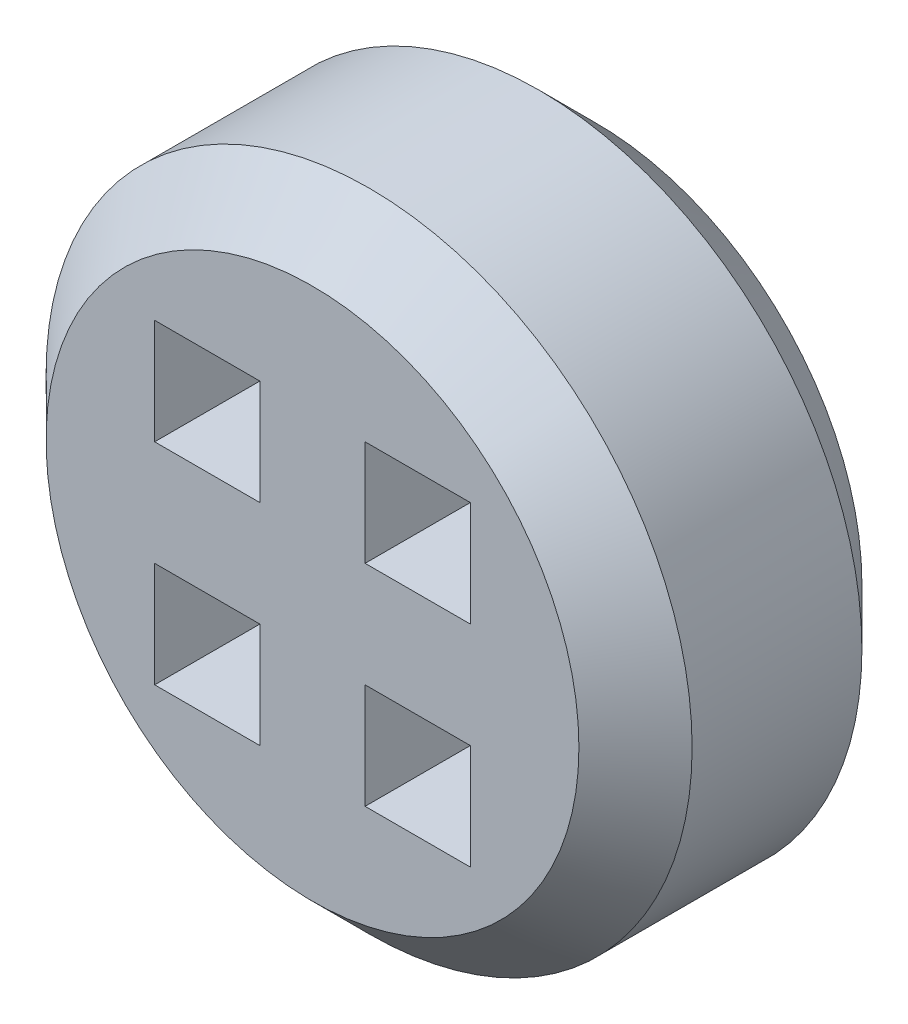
ISO-10303-21;
HEADER;
FILE_DESCRIPTION(('STEP AP214'),'2;1');
FILE_NAME('part.step','',(''),(''),'','','');
FILE_SCHEMA(('AUTOMOTIVE_DESIGN { 1 0 10303 214 1 1 1 1 }'));
ENDSEC;
DATA;
#1=APPLICATION_CONTEXT('core data for automotive mechanical design processes');
#2=APPLICATION_PROTOCOL_DEFINITION('international standard','automotive_design',2000,#1);
#3=PRODUCT_CONTEXT('',#1,'mechanical');
#4=PRODUCT('Part','Part','',(#3));
#5=PRODUCT_RELATED_PRODUCT_CATEGORY('part','',(#4));
#6=PRODUCT_DEFINITION_FORMATION('','',#4);
#7=PRODUCT_DEFINITION_CONTEXT('part definition',#1,'design');
#8=PRODUCT_DEFINITION('design','',#6,#7);
#9=PRODUCT_DEFINITION_SHAPE('','',#8);
#10=(LENGTH_UNIT() NAMED_UNIT(*) SI_UNIT(.MILLI.,.METRE.));
#11=(NAMED_UNIT(*) PLANE_ANGLE_UNIT() SI_UNIT($,.RADIAN.));
#12=(NAMED_UNIT(*) SI_UNIT($,.STERADIAN.) SOLID_ANGLE_UNIT());
#13=UNCERTAINTY_MEASURE_WITH_UNIT(LENGTH_MEASURE(1.E-05),#10,'distance_accuracy_value','');
#14=(GEOMETRIC_REPRESENTATION_CONTEXT(3) GLOBAL_UNCERTAINTY_ASSIGNED_CONTEXT((#13)) GLOBAL_UNIT_ASSIGNED_CONTEXT((#10,
#11,#12)) REPRESENTATION_CONTEXT('',''));
#15=CARTESIAN_POINT('',(0.,0.,0.));
#16=DIRECTION('',(0.,0.,1.));
#17=DIRECTION('',(1.,0.,0.));
#18=AXIS2_PLACEMENT_3D('',#15,#16,#17);
#19=CARTESIAN_POINT('',(0.,0.,50.));
#20=DIRECTION('',(0.,0.,-1.));
#21=DIRECTION('',(-1.,0.,0.));
#22=AXIS2_PLACEMENT_3D('',#19,#20,#21);
#23=CYLINDRICAL_SURFACE('',#22,57.0709565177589);
#24=CARTESIAN_POINT('',(0.,0.,10.));
#25=DIRECTION('',(0.,0.,1.));
#26=DIRECTION('',(1.,0.,0.));
#27=AXIS2_PLACEMENT_3D('',#24,#25,#26);
#28=CIRCLE('',#27,57.0709565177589);
#29=CARTESIAN_POINT('',(57.0709565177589,0.,10.));
#30=VERTEX_POINT('',#29);
#31=EDGE_CURVE('E277',#30,#30,#28,.T.);
#32=ORIENTED_EDGE('',*,*,#31,.T.);
#33=EDGE_LOOP('',(#32));
#34=FACE_BOUND('',#33,.T.);
#35=CARTESIAN_POINT('',(0.,0.,40.));
#36=DIRECTION('',(0.,0.,1.));
#37=DIRECTION('',(1.,0.,0.));
#38=AXIS2_PLACEMENT_3D('',#35,#36,#37);
#39=CIRCLE('',#38,57.0709565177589);
#40=CARTESIAN_POINT('',(57.0709565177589,0.,40.));
#41=VERTEX_POINT('',#40);
#42=EDGE_CURVE('E274',#41,#41,#39,.F.);
#43=ORIENTED_EDGE('',*,*,#42,.T.);
#44=EDGE_LOOP('',(#43));
#45=FACE_BOUND('',#44,.T.);
#46=ADVANCED_FACE('F32',(#34,#45),#23,.T.);
#47=CARTESIAN_POINT('',(0.,0.,50.));
#48=DIRECTION('',(0.,0.,1.));
#49=DIRECTION('',(1.,0.,0.));
#50=AXIS2_PLACEMENT_3D('',#47,#48,#49);
#51=PLANE('',#50);
#52=CARTESIAN_POINT('',(0.,0.,50.));
#53=DIRECTION('',(0.,0.,1.));
#54=DIRECTION('',(1.,0.,0.));
#55=AXIS2_PLACEMENT_3D('',#52,#53,#54);
#56=CIRCLE('',#55,47.070956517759);
#57=CARTESIAN_POINT('',(47.070956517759,0.,50.));
#58=VERTEX_POINT('',#57);
#59=EDGE_CURVE('E11',#58,#58,#56,.T.);
#60=ORIENTED_EDGE('',*,*,#59,.T.);
#61=EDGE_LOOP('',(#60));
#62=FACE_BOUND('',#61,.T.);
#63=DIRECTION('',(0.,1.,0.));
#64=VECTOR('',#63,1.);
#65=CARTESIAN_POINT('',(-9.29559077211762,-9.29559077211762,50.));
#66=LINE('',#65,#64);
#67=CARTESIAN_POINT('',(-9.29559077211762,-27.8867723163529,50.));
#68=VERTEX_POINT('',#67);
#69=CARTESIAN_POINT('',(-9.29559077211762,-9.29559077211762,50.));
#70=VERTEX_POINT('',#69);
#71=EDGE_CURVE('E47',#68,#70,#66,.T.);
#72=ORIENTED_EDGE('',*,*,#71,.F.);
#73=DIRECTION('',(1.,0.,0.));
#74=VECTOR('',#73,1.);
#75=CARTESIAN_POINT('',(-27.8867723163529,-27.8867723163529,50.));
#76=LINE('',#75,#74);
#77=CARTESIAN_POINT('',(-27.8867723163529,-27.8867723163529,50.));
#78=VERTEX_POINT('',#77);
#79=EDGE_CURVE('E153',#78,#68,#76,.T.);
#80=ORIENTED_EDGE('',*,*,#79,.F.);
#81=DIRECTION('',(0.,-1.,0.));
#82=VECTOR('',#81,1.);
#83=CARTESIAN_POINT('',(-27.8867723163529,-9.29559077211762,50.));
#84=LINE('',#83,#82);
#85=CARTESIAN_POINT('',(-27.8867723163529,-9.29559077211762,50.));
#86=VERTEX_POINT('',#85);
#87=EDGE_CURVE('E173',#86,#78,#84,.T.);
#88=ORIENTED_EDGE('',*,*,#87,.F.);
#89=DIRECTION('',(-1.,0.,0.));
#90=VECTOR('',#89,1.);
#91=CARTESIAN_POINT('',(-27.8867723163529,-9.29559077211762,50.));
#92=LINE('',#91,#90);
#93=EDGE_CURVE('E167',#70,#86,#92,.T.);
#94=ORIENTED_EDGE('',*,*,#93,.F.);
#95=EDGE_LOOP('',(#72,#80,#88,#94));
#96=FACE_BOUND('',#95,.T.);
#97=DIRECTION('',(0.,-1.,0.));
#98=VECTOR('',#97,1.);
#99=CARTESIAN_POINT('',(9.29559077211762,-9.29559077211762,50.));
#100=LINE('',#99,#98);
#101=CARTESIAN_POINT('',(9.29559077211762,-9.29559077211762,50.));
#102=VERTEX_POINT('',#101);
#103=CARTESIAN_POINT('',(9.29559077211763,-27.8867723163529,50.));
#104=VERTEX_POINT('',#103);
#105=EDGE_CURVE('E189',#102,#104,#100,.T.);
#106=ORIENTED_EDGE('',*,*,#105,.F.);
#107=DIRECTION('',(-1.,0.,0.));
#108=VECTOR('',#107,1.);
#109=CARTESIAN_POINT('',(9.29559077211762,-9.29559077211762,50.));
#110=LINE('',#109,#108);
#111=CARTESIAN_POINT('',(27.8867723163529,-9.29559077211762,50.));
#112=VERTEX_POINT('',#111);
#113=EDGE_CURVE('E197',#112,#102,#110,.T.);
#114=ORIENTED_EDGE('',*,*,#113,.F.);
#115=DIRECTION('',(0.,1.,0.));
#116=VECTOR('',#115,1.);
#117=CARTESIAN_POINT('',(27.8867723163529,-9.29559077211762,50.));
#118=LINE('',#117,#116);
#119=CARTESIAN_POINT('',(27.8867723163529,-27.8867723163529,50.));
#120=VERTEX_POINT('',#119);
#121=EDGE_CURVE('E194',#120,#112,#118,.T.);
#122=ORIENTED_EDGE('',*,*,#121,.F.);
#123=DIRECTION('',(1.,0.,0.));
#124=VECTOR('',#123,1.);
#125=CARTESIAN_POINT('',(9.29559077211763,-27.8867723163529,50.));
#126=LINE('',#125,#124);
#127=EDGE_CURVE('E191',#104,#120,#126,.T.);
#128=ORIENTED_EDGE('',*,*,#127,.F.);
#129=EDGE_LOOP('',(#106,#114,#122,#128));
#130=FACE_BOUND('',#129,.T.);
#131=DIRECTION('',(0.,1.,0.));
#132=VECTOR('',#131,1.);
#133=CARTESIAN_POINT('',(-9.29559077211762,27.8867723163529,50.));
#134=LINE('',#133,#132);
#135=CARTESIAN_POINT('',(-9.29559077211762,9.29559077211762,50.));
#136=VERTEX_POINT('',#135);
#137=CARTESIAN_POINT('',(-9.29559077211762,27.8867723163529,50.));
#138=VERTEX_POINT('',#137);
#139=EDGE_CURVE('E220',#136,#138,#134,.T.);
#140=ORIENTED_EDGE('',*,*,#139,.F.);
#141=DIRECTION('',(1.,0.,0.));
#142=VECTOR('',#141,1.);
#143=CARTESIAN_POINT('',(-27.8867723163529,9.29559077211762,50.));
#144=LINE('',#143,#142);
#145=CARTESIAN_POINT('',(-27.8867723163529,9.29559077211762,50.));
#146=VERTEX_POINT('',#145);
#147=EDGE_CURVE('E228',#146,#136,#144,.T.);
#148=ORIENTED_EDGE('',*,*,#147,.F.);
#149=DIRECTION('',(0.,-1.,0.));
#150=VECTOR('',#149,1.);
#151=CARTESIAN_POINT('',(-27.8867723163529,27.8867723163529,50.));
#152=LINE('',#151,#150);
#153=CARTESIAN_POINT('',(-27.8867723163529,27.8867723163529,50.));
#154=VERTEX_POINT('',#153);
#155=EDGE_CURVE('E225',#154,#146,#152,.T.);
#156=ORIENTED_EDGE('',*,*,#155,.F.);
#157=DIRECTION('',(-1.,0.,0.));
#158=VECTOR('',#157,1.);
#159=CARTESIAN_POINT('',(-27.8867723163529,27.8867723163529,50.));
#160=LINE('',#159,#158);
#161=EDGE_CURVE('E222',#138,#154,#160,.T.);
#162=ORIENTED_EDGE('',*,*,#161,.F.);
#163=EDGE_LOOP('',(#140,#148,#156,#162));
#164=FACE_BOUND('',#163,.T.);
#165=DIRECTION('',(0.,-1.,0.));
#166=VECTOR('',#165,1.);
#167=CARTESIAN_POINT('',(9.29559077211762,27.8867723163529,50.));
#168=LINE('',#167,#166);
#169=CARTESIAN_POINT('',(9.29559077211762,27.8867723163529,50.));
#170=VERTEX_POINT('',#169);
#171=CARTESIAN_POINT('',(9.29559077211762,9.29559077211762,50.));
#172=VERTEX_POINT('',#171);
#173=EDGE_CURVE('E251',#170,#172,#168,.T.);
#174=ORIENTED_EDGE('',*,*,#173,.F.);
#175=DIRECTION('',(-1.,0.,0.));
#176=VECTOR('',#175,1.);
#177=CARTESIAN_POINT('',(9.29559077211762,27.8867723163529,50.));
#178=LINE('',#177,#176);
#179=CARTESIAN_POINT('',(27.8867723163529,27.8867723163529,50.));
#180=VERTEX_POINT('',#179);
#181=EDGE_CURVE('E259',#180,#170,#178,.T.);
#182=ORIENTED_EDGE('',*,*,#181,.F.);
#183=DIRECTION('',(0.,1.,0.));
#184=VECTOR('',#183,1.);
#185=CARTESIAN_POINT('',(27.8867723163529,27.8867723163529,50.));
#186=LINE('',#185,#184);
#187=CARTESIAN_POINT('',(27.8867723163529,9.29559077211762,50.));
#188=VERTEX_POINT('',#187);
#189=EDGE_CURVE('E256',#188,#180,#186,.T.);
#190=ORIENTED_EDGE('',*,*,#189,.F.);
#191=DIRECTION('',(1.,0.,0.));
#192=VECTOR('',#191,1.);
#193=CARTESIAN_POINT('',(9.29559077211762,9.29559077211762,50.));
#194=LINE('',#193,#192);
#195=EDGE_CURVE('E253',#172,#188,#194,.T.);
#196=ORIENTED_EDGE('',*,*,#195,.F.);
#197=EDGE_LOOP('',(#174,#182,#190,#196));
#198=FACE_BOUND('',#197,.T.);
#199=ADVANCED_FACE('F290',(#62,#96,#130,#164,#198),#51,.T.);
#200=CARTESIAN_POINT('',(0.,0.,0.));
#201=DIRECTION('',(0.,0.,1.));
#202=DIRECTION('',(1.,0.,0.));
#203=AXIS2_PLACEMENT_3D('',#200,#201,#202);
#204=PLANE('',#203);
#205=CARTESIAN_POINT('',(0.,0.,0.));
#206=DIRECTION('',(0.,0.,1.));
#207=DIRECTION('',(1.,0.,0.));
#208=AXIS2_PLACEMENT_3D('',#205,#206,#207);
#209=CIRCLE('',#208,47.0709565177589);
#210=CARTESIAN_POINT('',(47.0709565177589,0.,0.));
#211=VERTEX_POINT('',#210);
#212=EDGE_CURVE('E40',#211,#211,#209,.F.);
#213=ORIENTED_EDGE('',*,*,#212,.T.);
#214=EDGE_LOOP('',(#213));
#215=FACE_BOUND('',#214,.T.);
#216=DIRECTION('',(-1.,0.,0.));
#217=VECTOR('',#216,1.);
#218=CARTESIAN_POINT('',(-27.8867723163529,-27.8867723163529,0.));
#219=LINE('',#218,#217);
#220=CARTESIAN_POINT('',(-9.29559077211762,-27.8867723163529,0.));
#221=VERTEX_POINT('',#220);
#222=CARTESIAN_POINT('',(-27.8867723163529,-27.8867723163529,0.));
#223=VERTEX_POINT('',#222);
#224=EDGE_CURVE('E165',#221,#223,#219,.T.);
#225=ORIENTED_EDGE('',*,*,#224,.F.);
#226=DIRECTION('',(0.,-1.,0.));
#227=VECTOR('',#226,1.);
#228=CARTESIAN_POINT('',(-9.29559077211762,-9.29559077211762,0.));
#229=LINE('',#228,#227);
#230=CARTESIAN_POINT('',(-9.29559077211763,-9.29559077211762,0.));
#231=VERTEX_POINT('',#230);
#232=EDGE_CURVE('E147',#231,#221,#229,.T.);
#233=ORIENTED_EDGE('',*,*,#232,.F.);
#234=DIRECTION('',(1.,0.,0.));
#235=VECTOR('',#234,1.);
#236=CARTESIAN_POINT('',(-27.8867723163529,-9.29559077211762,0.));
#237=LINE('',#236,#235);
#238=CARTESIAN_POINT('',(-27.8867723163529,-9.29559077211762,0.));
#239=VERTEX_POINT('',#238);
#240=EDGE_CURVE('E156',#239,#231,#237,.T.);
#241=ORIENTED_EDGE('',*,*,#240,.F.);
#242=DIRECTION('',(0.,1.,0.));
#243=VECTOR('',#242,1.);
#244=CARTESIAN_POINT('',(-27.8867723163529,-9.29559077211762,0.));
#245=LINE('',#244,#243);
#246=EDGE_CURVE('E55',#223,#239,#245,.T.);
#247=ORIENTED_EDGE('',*,*,#246,.F.);
#248=EDGE_LOOP('',(#225,#233,#241,#247));
#249=FACE_BOUND('',#248,.T.);
#250=DIRECTION('',(1.,0.,0.));
#251=VECTOR('',#250,1.);
#252=CARTESIAN_POINT('',(9.29559077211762,-9.29559077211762,0.));
#253=LINE('',#252,#251);
#254=CARTESIAN_POINT('',(9.29559077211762,-9.29559077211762,0.));
#255=VERTEX_POINT('',#254);
#256=CARTESIAN_POINT('',(27.8867723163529,-9.29559077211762,0.));
#257=VERTEX_POINT('',#256);
#258=EDGE_CURVE('E183',#255,#257,#253,.T.);
#259=ORIENTED_EDGE('',*,*,#258,.F.);
#260=DIRECTION('',(0.,1.,0.));
#261=VECTOR('',#260,1.);
#262=CARTESIAN_POINT('',(9.29559077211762,-9.29559077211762,0.));
#263=LINE('',#262,#261);
#264=CARTESIAN_POINT('',(9.29559077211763,-27.8867723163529,0.));
#265=VERTEX_POINT('',#264);
#266=EDGE_CURVE('E186',#265,#255,#263,.T.);
#267=ORIENTED_EDGE('',*,*,#266,.F.);
#268=DIRECTION('',(-1.,0.,0.));
#269=VECTOR('',#268,1.);
#270=CARTESIAN_POINT('',(9.29559077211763,-27.8867723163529,0.));
#271=LINE('',#270,#269);
#272=CARTESIAN_POINT('',(27.8867723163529,-27.8867723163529,0.));
#273=VERTEX_POINT('',#272);
#274=EDGE_CURVE('E203',#273,#265,#271,.T.);
#275=ORIENTED_EDGE('',*,*,#274,.F.);
#276=DIRECTION('',(0.,-1.,0.));
#277=VECTOR('',#276,1.);
#278=CARTESIAN_POINT('',(27.8867723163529,-9.29559077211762,0.));
#279=LINE('',#278,#277);
#280=EDGE_CURVE('E159',#257,#273,#279,.T.);
#281=ORIENTED_EDGE('',*,*,#280,.F.);
#282=EDGE_LOOP('',(#259,#267,#275,#281));
#283=FACE_BOUND('',#282,.T.);
#284=DIRECTION('',(-1.,0.,0.));
#285=VECTOR('',#284,1.);
#286=CARTESIAN_POINT('',(-27.8867723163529,9.29559077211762,0.));
#287=LINE('',#286,#285);
#288=CARTESIAN_POINT('',(-9.29559077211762,9.29559077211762,0.));
#289=VERTEX_POINT('',#288);
#290=CARTESIAN_POINT('',(-27.8867723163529,9.29559077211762,0.));
#291=VERTEX_POINT('',#290);
#292=EDGE_CURVE('E214',#289,#291,#287,.T.);
#293=ORIENTED_EDGE('',*,*,#292,.F.);
#294=DIRECTION('',(0.,-1.,0.));
#295=VECTOR('',#294,1.);
#296=CARTESIAN_POINT('',(-9.29559077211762,27.8867723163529,0.));
#297=LINE('',#296,#295);
#298=CARTESIAN_POINT('',(-9.29559077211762,27.8867723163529,0.));
#299=VERTEX_POINT('',#298);
#300=EDGE_CURVE('E217',#299,#289,#297,.T.);
#301=ORIENTED_EDGE('',*,*,#300,.F.);
#302=DIRECTION('',(1.,0.,0.));
#303=VECTOR('',#302,1.);
#304=CARTESIAN_POINT('',(-27.8867723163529,27.8867723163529,0.));
#305=LINE('',#304,#303);
#306=CARTESIAN_POINT('',(-27.8867723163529,27.8867723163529,0.));
#307=VERTEX_POINT('',#306);
#308=EDGE_CURVE('E234',#307,#299,#305,.T.);
#309=ORIENTED_EDGE('',*,*,#308,.F.);
#310=DIRECTION('',(0.,1.,0.));
#311=VECTOR('',#310,1.);
#312=CARTESIAN_POINT('',(-27.8867723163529,27.8867723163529,0.));
#313=LINE('',#312,#311);
#314=EDGE_CURVE('E212',#291,#307,#313,.T.);
#315=ORIENTED_EDGE('',*,*,#314,.F.);
#316=EDGE_LOOP('',(#293,#301,#309,#315));
#317=FACE_BOUND('',#316,.T.);
#318=DIRECTION('',(1.,0.,0.));
#319=VECTOR('',#318,1.);
#320=CARTESIAN_POINT('',(9.29559077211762,27.8867723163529,0.));
#321=LINE('',#320,#319);
#322=CARTESIAN_POINT('',(9.29559077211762,27.8867723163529,0.));
#323=VERTEX_POINT('',#322);
#324=CARTESIAN_POINT('',(27.8867723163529,27.8867723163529,0.));
#325=VERTEX_POINT('',#324);
#326=EDGE_CURVE('E245',#323,#325,#321,.T.);
#327=ORIENTED_EDGE('',*,*,#326,.F.);
#328=DIRECTION('',(0.,1.,0.));
#329=VECTOR('',#328,1.);
#330=CARTESIAN_POINT('',(9.29559077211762,27.8867723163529,0.));
#331=LINE('',#330,#329);
#332=CARTESIAN_POINT('',(9.29559077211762,9.29559077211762,0.));
#333=VERTEX_POINT('',#332);
#334=EDGE_CURVE('E248',#333,#323,#331,.T.);
#335=ORIENTED_EDGE('',*,*,#334,.F.);
#336=DIRECTION('',(-1.,0.,0.));
#337=VECTOR('',#336,1.);
#338=CARTESIAN_POINT('',(9.29559077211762,9.29559077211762,0.));
#339=LINE('',#338,#337);
#340=CARTESIAN_POINT('',(27.8867723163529,9.29559077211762,0.));
#341=VERTEX_POINT('',#340);
#342=EDGE_CURVE('E265',#341,#333,#339,.T.);
#343=ORIENTED_EDGE('',*,*,#342,.F.);
#344=DIRECTION('',(0.,-1.,0.));
#345=VECTOR('',#344,1.);
#346=CARTESIAN_POINT('',(27.8867723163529,27.8867723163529,0.));
#347=LINE('',#346,#345);
#348=EDGE_CURVE('E243',#325,#341,#347,.T.);
#349=ORIENTED_EDGE('',*,*,#348,.F.);
#350=EDGE_LOOP('',(#327,#335,#343,#349));
#351=FACE_BOUND('',#350,.T.);
#352=ADVANCED_FACE('F162',(#215,#249,#283,#317,#351),#204,.F.);
#353=CARTESIAN_POINT('',(9.29559077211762,27.8867723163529,-0.001000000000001));
#354=DIRECTION('',(-1.,0.,0.));
#355=DIRECTION('',(0.,0.,1.));
#356=AXIS2_PLACEMENT_3D('',#353,#354,#355);
#357=PLANE('',#356);
#358=ORIENTED_EDGE('',*,*,#334,.T.);
#359=DIRECTION('',(0.,0.,1.));
#360=VECTOR('',#359,1.);
#361=CARTESIAN_POINT('',(9.29559077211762,27.8867723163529,-0.001000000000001));
#362=LINE('',#361,#360);
#363=EDGE_CURVE('E263',#323,#170,#362,.T.);
#364=ORIENTED_EDGE('',*,*,#363,.T.);
#365=ORIENTED_EDGE('',*,*,#173,.T.);
#366=DIRECTION('',(0.,0.,1.));
#367=VECTOR('',#366,1.);
#368=CARTESIAN_POINT('',(9.29559077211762,9.29559077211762,-0.001000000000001));
#369=LINE('',#368,#367);
#370=EDGE_CURVE('E262',#333,#172,#369,.T.);
#371=ORIENTED_EDGE('',*,*,#370,.F.);
#372=EDGE_LOOP('',(#358,#364,#365,#371));
#373=FACE_BOUND('',#372,.T.);
#374=ADVANCED_FACE('F316',(#373),#357,.F.);
#375=CARTESIAN_POINT('',(9.29559077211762,27.8867723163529,-0.001000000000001));
#376=DIRECTION('',(0.,1.,0.));
#377=DIRECTION('',(0.,0.,1.));
#378=AXIS2_PLACEMENT_3D('',#375,#376,#377);
#379=PLANE('',#378);
#380=ORIENTED_EDGE('',*,*,#326,.T.);
#381=DIRECTION('',(0.,0.,1.));
#382=VECTOR('',#381,1.);
#383=CARTESIAN_POINT('',(27.8867723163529,27.8867723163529,-0.001000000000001));
#384=LINE('',#383,#382);
#385=EDGE_CURVE('E266',#325,#180,#384,.T.);
#386=ORIENTED_EDGE('',*,*,#385,.T.);
#387=ORIENTED_EDGE('',*,*,#181,.T.);
#388=ORIENTED_EDGE('',*,*,#363,.F.);
#389=EDGE_LOOP('',(#380,#386,#387,#388));
#390=FACE_BOUND('',#389,.T.);
#391=ADVANCED_FACE('F326',(#390),#379,.F.);
#392=CARTESIAN_POINT('',(27.8867723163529,27.8867723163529,-0.001000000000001));
#393=DIRECTION('',(1.,0.,0.));
#394=DIRECTION('',(0.,0.,-1.));
#395=AXIS2_PLACEMENT_3D('',#392,#393,#394);
#396=PLANE('',#395);
#397=ORIENTED_EDGE('',*,*,#348,.T.);
#398=DIRECTION('',(0.,0.,1.));
#399=VECTOR('',#398,1.);
#400=CARTESIAN_POINT('',(27.8867723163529,9.29559077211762,-0.001000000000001));
#401=LINE('',#400,#399);
#402=EDGE_CURVE('E268',#341,#188,#401,.T.);
#403=ORIENTED_EDGE('',*,*,#402,.T.);
#404=ORIENTED_EDGE('',*,*,#189,.T.);
#405=ORIENTED_EDGE('',*,*,#385,.F.);
#406=EDGE_LOOP('',(#397,#403,#404,#405));
#407=FACE_BOUND('',#406,.T.);
#408=ADVANCED_FACE('F328',(#407),#396,.F.);
#409=CARTESIAN_POINT('',(9.29559077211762,9.29559077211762,-0.001000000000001));
#410=DIRECTION('',(0.,-1.,0.));
#411=DIRECTION('',(0.,0.,-1.));
#412=AXIS2_PLACEMENT_3D('',#409,#410,#411);
#413=PLANE('',#412);
#414=ORIENTED_EDGE('',*,*,#342,.T.);
#415=ORIENTED_EDGE('',*,*,#370,.T.);
#416=ORIENTED_EDGE('',*,*,#195,.T.);
#417=ORIENTED_EDGE('',*,*,#402,.F.);
#418=EDGE_LOOP('',(#414,#415,#416,#417));
#419=FACE_BOUND('',#418,.T.);
#420=ADVANCED_FACE('F318',(#419),#413,.F.);
#421=CARTESIAN_POINT('',(-9.29559077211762,27.8867723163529,-0.001000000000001));
#422=DIRECTION('',(1.,0.,0.));
#423=DIRECTION('',(0.,0.,-1.));
#424=AXIS2_PLACEMENT_3D('',#421,#422,#423);
#425=PLANE('',#424);
#426=ORIENTED_EDGE('',*,*,#300,.T.);
#427=DIRECTION('',(0.,0.,1.));
#428=VECTOR('',#427,1.);
#429=CARTESIAN_POINT('',(-9.29559077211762,9.29559077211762,-0.001000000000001));
#430=LINE('',#429,#428);
#431=EDGE_CURVE('E232',#289,#136,#430,.T.);
#432=ORIENTED_EDGE('',*,*,#431,.T.);
#433=ORIENTED_EDGE('',*,*,#139,.T.);
#434=DIRECTION('',(0.,0.,1.));
#435=VECTOR('',#434,1.);
#436=CARTESIAN_POINT('',(-9.29559077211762,27.8867723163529,-0.001000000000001));
#437=LINE('',#436,#435);
#438=EDGE_CURVE('E231',#299,#138,#437,.T.);
#439=ORIENTED_EDGE('',*,*,#438,.F.);
#440=EDGE_LOOP('',(#426,#432,#433,#439));
#441=FACE_BOUND('',#440,.T.);
#442=ADVANCED_FACE('F335',(#441),#425,.F.);
#443=CARTESIAN_POINT('',(-27.8867723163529,9.29559077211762,-0.001000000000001));
#444=DIRECTION('',(0.,-1.,0.));
#445=DIRECTION('',(0.,0.,-1.));
#446=AXIS2_PLACEMENT_3D('',#443,#444,#445);
#447=PLANE('',#446);
#448=ORIENTED_EDGE('',*,*,#292,.T.);
#449=DIRECTION('',(0.,0.,1.));
#450=VECTOR('',#449,1.);
#451=CARTESIAN_POINT('',(-27.8867723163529,9.29559077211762,-0.001000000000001));
#452=LINE('',#451,#450);
#453=EDGE_CURVE('E235',#291,#146,#452,.T.);
#454=ORIENTED_EDGE('',*,*,#453,.T.);
#455=ORIENTED_EDGE('',*,*,#147,.T.);
#456=ORIENTED_EDGE('',*,*,#431,.F.);
#457=EDGE_LOOP('',(#448,#454,#455,#456));
#458=FACE_BOUND('',#457,.T.);
#459=ADVANCED_FACE('F375',(#458),#447,.F.);
#460=CARTESIAN_POINT('',(-27.8867723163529,27.8867723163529,-0.001000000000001));
#461=DIRECTION('',(-1.,0.,0.));
#462=DIRECTION('',(0.,-1.,0.));
#463=AXIS2_PLACEMENT_3D('',#460,#461,#462);
#464=PLANE('',#463);
#465=ORIENTED_EDGE('',*,*,#314,.T.);
#466=DIRECTION('',(0.,0.,1.));
#467=VECTOR('',#466,1.);
#468=CARTESIAN_POINT('',(-27.8867723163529,27.8867723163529,-0.001000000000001));
#469=LINE('',#468,#467);
#470=EDGE_CURVE('E237',#307,#154,#469,.T.);
#471=ORIENTED_EDGE('',*,*,#470,.T.);
#472=ORIENTED_EDGE('',*,*,#155,.T.);
#473=ORIENTED_EDGE('',*,*,#453,.F.);
#474=EDGE_LOOP('',(#465,#471,#472,#473));
#475=FACE_BOUND('',#474,.T.);
#476=ADVANCED_FACE('F384',(#475),#464,.F.);
#477=CARTESIAN_POINT('',(-27.8867723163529,27.8867723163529,-0.001000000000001));
#478=DIRECTION('',(0.,1.,0.));
#479=DIRECTION('',(0.,0.,1.));
#480=AXIS2_PLACEMENT_3D('',#477,#478,#479);
#481=PLANE('',#480);
#482=ORIENTED_EDGE('',*,*,#308,.T.);
#483=ORIENTED_EDGE('',*,*,#438,.T.);
#484=ORIENTED_EDGE('',*,*,#161,.T.);
#485=ORIENTED_EDGE('',*,*,#470,.F.);
#486=EDGE_LOOP('',(#482,#483,#484,#485));
#487=FACE_BOUND('',#486,.T.);
#488=ADVANCED_FACE('F394',(#487),#481,.F.);
#489=CARTESIAN_POINT('',(9.29559077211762,-9.29559077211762,-0.001000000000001));
#490=DIRECTION('',(-1.,0.,0.));
#491=DIRECTION('',(0.,-1.,0.));
#492=AXIS2_PLACEMENT_3D('',#489,#490,#491);
#493=PLANE('',#492);
#494=ORIENTED_EDGE('',*,*,#266,.T.);
#495=DIRECTION('',(0.,0.,1.));
#496=VECTOR('',#495,1.);
#497=CARTESIAN_POINT('',(9.29559077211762,-9.29559077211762,-0.001000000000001));
#498=LINE('',#497,#496);
#499=EDGE_CURVE('E201',#255,#102,#498,.T.);
#500=ORIENTED_EDGE('',*,*,#499,.T.);
#501=ORIENTED_EDGE('',*,*,#105,.T.);
#502=DIRECTION('',(0.,0.,1.));
#503=VECTOR('',#502,1.);
#504=CARTESIAN_POINT('',(9.29559077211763,-27.8867723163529,-0.001000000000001));
#505=LINE('',#504,#503);
#506=EDGE_CURVE('E200',#265,#104,#505,.T.);
#507=ORIENTED_EDGE('',*,*,#506,.F.);
#508=EDGE_LOOP('',(#494,#500,#501,#507));
#509=FACE_BOUND('',#508,.T.);
#510=ADVANCED_FACE('F404',(#509),#493,.F.);
#511=CARTESIAN_POINT('',(9.29559077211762,-9.29559077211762,-0.001000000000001));
#512=DIRECTION('',(0.,1.,0.));
#513=DIRECTION('',(0.,0.,1.));
#514=AXIS2_PLACEMENT_3D('',#511,#512,#513);
#515=PLANE('',#514);
#516=ORIENTED_EDGE('',*,*,#258,.T.);
#517=DIRECTION('',(0.,0.,1.));
#518=VECTOR('',#517,1.);
#519=CARTESIAN_POINT('',(27.8867723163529,-9.29559077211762,-0.001000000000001));
#520=LINE('',#519,#518);
#521=EDGE_CURVE('E204',#257,#112,#520,.T.);
#522=ORIENTED_EDGE('',*,*,#521,.T.);
#523=ORIENTED_EDGE('',*,*,#113,.T.);
#524=ORIENTED_EDGE('',*,*,#499,.F.);
#525=EDGE_LOOP('',(#516,#522,#523,#524));
#526=FACE_BOUND('',#525,.T.);
#527=ADVANCED_FACE('F414',(#526),#515,.F.);
#528=CARTESIAN_POINT('',(27.8867723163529,-9.29559077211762,-0.001000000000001));
#529=DIRECTION('',(1.,0.,0.));
#530=DIRECTION('',(0.,1.,0.));
#531=AXIS2_PLACEMENT_3D('',#528,#529,#530);
#532=PLANE('',#531);
#533=ORIENTED_EDGE('',*,*,#280,.T.);
#534=DIRECTION('',(0.,0.,1.));
#535=VECTOR('',#534,1.);
#536=CARTESIAN_POINT('',(27.8867723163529,-27.8867723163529,-0.001000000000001));
#537=LINE('',#536,#535);
#538=EDGE_CURVE('E206',#273,#120,#537,.T.);
#539=ORIENTED_EDGE('',*,*,#538,.T.);
#540=ORIENTED_EDGE('',*,*,#121,.T.);
#541=ORIENTED_EDGE('',*,*,#521,.F.);
#542=EDGE_LOOP('',(#533,#539,#540,#541));
#543=FACE_BOUND('',#542,.T.);
#544=ADVANCED_FACE('F424',(#543),#532,.F.);
#545=CARTESIAN_POINT('',(9.29559077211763,-27.8867723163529,-0.001000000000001));
#546=DIRECTION('',(0.,-1.,0.));
#547=DIRECTION('',(0.,0.,-1.));
#548=AXIS2_PLACEMENT_3D('',#545,#546,#547);
#549=PLANE('',#548);
#550=ORIENTED_EDGE('',*,*,#274,.T.);
#551=ORIENTED_EDGE('',*,*,#506,.T.);
#552=ORIENTED_EDGE('',*,*,#127,.T.);
#553=ORIENTED_EDGE('',*,*,#538,.F.);
#554=EDGE_LOOP('',(#550,#551,#552,#553));
#555=FACE_BOUND('',#554,.T.);
#556=ADVANCED_FACE('F434',(#555),#549,.F.);
#557=CARTESIAN_POINT('',(-9.29559077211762,-9.29559077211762,-0.001000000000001));
#558=DIRECTION('',(1.,0.,0.));
#559=DIRECTION('',(0.,1.,0.));
#560=AXIS2_PLACEMENT_3D('',#557,#558,#559);
#561=PLANE('',#560);
#562=ORIENTED_EDGE('',*,*,#232,.T.);
#563=DIRECTION('',(0.,0.,1.));
#564=VECTOR('',#563,1.);
#565=CARTESIAN_POINT('',(-9.29559077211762,-27.8867723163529,-0.001000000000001));
#566=LINE('',#565,#564);
#567=EDGE_CURVE('E160',#221,#68,#566,.T.);
#568=ORIENTED_EDGE('',*,*,#567,.T.);
#569=ORIENTED_EDGE('',*,*,#71,.T.);
#570=DIRECTION('',(0.,0.,1.));
#571=VECTOR('',#570,1.);
#572=CARTESIAN_POINT('',(-9.29559077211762,-9.29559077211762,-0.001000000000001));
#573=LINE('',#572,#571);
#574=EDGE_CURVE('E143',#231,#70,#573,.T.);
#575=ORIENTED_EDGE('',*,*,#574,.F.);
#576=EDGE_LOOP('',(#562,#568,#569,#575));
#577=FACE_BOUND('',#576,.T.);
#578=ADVANCED_FACE('F145',(#577),#561,.F.);
#579=CARTESIAN_POINT('',(-27.8867723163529,-27.8867723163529,-0.001000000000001));
#580=DIRECTION('',(0.,-1.,0.));
#581=DIRECTION('',(0.,0.,-1.));
#582=AXIS2_PLACEMENT_3D('',#579,#580,#581);
#583=PLANE('',#582);
#584=ORIENTED_EDGE('',*,*,#224,.T.);
#585=DIRECTION('',(0.,0.,1.));
#586=VECTOR('',#585,1.);
#587=CARTESIAN_POINT('',(-27.8867723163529,-27.8867723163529,-0.001000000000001));
#588=LINE('',#587,#586);
#589=EDGE_CURVE('E179',#223,#78,#588,.T.);
#590=ORIENTED_EDGE('',*,*,#589,.T.);
#591=ORIENTED_EDGE('',*,*,#79,.T.);
#592=ORIENTED_EDGE('',*,*,#567,.F.);
#593=EDGE_LOOP('',(#584,#590,#591,#592));
#594=FACE_BOUND('',#593,.T.);
#595=ADVANCED_FACE('F453',(#594),#583,.F.);
#596=CARTESIAN_POINT('',(-27.8867723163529,-9.29559077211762,-0.001000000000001));
#597=DIRECTION('',(-1.,0.,0.));
#598=DIRECTION('',(0.,0.,1.));
#599=AXIS2_PLACEMENT_3D('',#596,#597,#598);
#600=PLANE('',#599);
#601=ORIENTED_EDGE('',*,*,#246,.T.);
#602=DIRECTION('',(0.,0.,1.));
#603=VECTOR('',#602,1.);
#604=CARTESIAN_POINT('',(-27.8867723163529,-9.29559077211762,-0.001000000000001));
#605=LINE('',#604,#603);
#606=EDGE_CURVE('E152',#239,#86,#605,.T.);
#607=ORIENTED_EDGE('',*,*,#606,.T.);
#608=ORIENTED_EDGE('',*,*,#87,.T.);
#609=ORIENTED_EDGE('',*,*,#589,.F.);
#610=EDGE_LOOP('',(#601,#607,#608,#609));
#611=FACE_BOUND('',#610,.T.);
#612=ADVANCED_FACE('F462',(#611),#600,.F.);
#613=CARTESIAN_POINT('',(-27.8867723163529,-9.29559077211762,-0.001000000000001));
#614=DIRECTION('',(0.,1.,0.));
#615=DIRECTION('',(0.,0.,1.));
#616=AXIS2_PLACEMENT_3D('',#613,#614,#615);
#617=PLANE('',#616);
#618=ORIENTED_EDGE('',*,*,#240,.T.);
#619=ORIENTED_EDGE('',*,*,#574,.T.);
#620=ORIENTED_EDGE('',*,*,#93,.T.);
#621=ORIENTED_EDGE('',*,*,#606,.F.);
#622=EDGE_LOOP('',(#618,#619,#620,#621));
#623=FACE_BOUND('',#622,.T.);
#624=ADVANCED_FACE('F157',(#623),#617,.F.);
#625=CARTESIAN_POINT('',(0.,0.,10.));
#626=DIRECTION('',(0.,0.,1.));
#627=DIRECTION('',(1.,0.,0.));
#628=AXIS2_PLACEMENT_3D('',#625,#626,#627);
#629=CONICAL_SURFACE('',#628,57.0709565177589,0.78539816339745);
#630=ORIENTED_EDGE('',*,*,#212,.F.);
#631=EDGE_LOOP('',(#630));
#632=FACE_BOUND('',#631,.T.);
#633=ORIENTED_EDGE('',*,*,#31,.F.);
#634=EDGE_LOOP('',(#633));
#635=FACE_BOUND('',#634,.T.);
#636=ADVANCED_FACE('F283',(#632,#635),#629,.T.);
#637=CARTESIAN_POINT('',(0.,0.,50.));
#638=DIRECTION('',(0.,0.,-1.));
#639=DIRECTION('',(-1.,0.,0.));
#640=AXIS2_PLACEMENT_3D('',#637,#638,#639);
#641=CONICAL_SURFACE('',#640,47.070956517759,0.785398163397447);
#642=ORIENTED_EDGE('',*,*,#42,.F.);
#643=EDGE_LOOP('',(#642));
#644=FACE_BOUND('',#643,.T.);
#645=ORIENTED_EDGE('',*,*,#59,.F.);
#646=EDGE_LOOP('',(#645));
#647=FACE_BOUND('',#646,.T.);
#648=ADVANCED_FACE('F34',(#644,#647),#641,.T.);
#649=CLOSED_SHELL('',(#46,#199,#352,#374,#391,#408,#420,#442,#459,#476,#488,#510,#527,#544,#556,
#578,#595,#612,#624,#636,#648));
#650=MANIFOLD_SOLID_BREP('B2',#649);
#651=ADVANCED_BREP_SHAPE_REPRESENTATION('',(#18,#650),#14);
#652=SHAPE_DEFINITION_REPRESENTATION(#9,#651);
ENDSEC;
END-ISO-10303-21;
